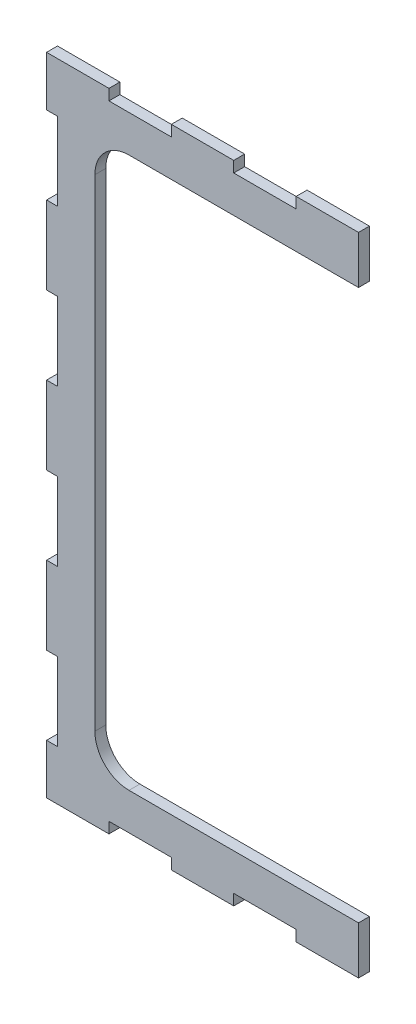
from build123d import *

# Parameters (mm, degrees)
BOSS_EXTRUDE1_DEPTH = 16
FILLET2_R           = 50


with BuildPart() as part:
    # Sketch1 → Boss-Extrude1 (new body)
    with BuildSketch(Plane.XY):
        Polygon((-311.421446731, 497.074365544), (-311.421446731, 513.074365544), (-402.861446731, 513.074365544), (-402.861446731, 497.074365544), (-494.301446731, 497.074365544), (-494.301446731, 513.074365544), (-585.741446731, 513.074365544), (-585.741446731, 439.922365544), (-569.741446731, 439.922365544), (-569.741446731, 325.622365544), (-585.741446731, 325.622365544), (-585.741446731, 211.323698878), (-569.741446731, 211.323698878), (-569.741446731, 97.023698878), (-585.741446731, 97.023698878), (-585.741446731, -17.274967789), (-569.741446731, -17.274967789), (-569.741446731, -131.574967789), (-585.741446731, -131.574967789), (-585.741446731, -245.873634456), (-569.741446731, -245.873634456), (-569.741446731, -360.173634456), (-585.741446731, -360.173634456), (-585.741446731, -433.325634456), (-494.301446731, -433.325634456), (-494.301446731, -417.325634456), (-402.861446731, -417.325634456), (-402.861446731, -433.325634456), (-311.421446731, -433.325634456), (-311.421446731, -417.325634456), (-219.981446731, -417.325634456), (-219.981446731, -433.325634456), (-128.541446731, -433.325634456), (-128.541446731, -363.325634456), (-514.981446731, -363.325634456), (-514.981446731, 443.074365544), (-128.541446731, 443.074365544), (-128.541446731, 513.074365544), (-219.981446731, 513.074365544), (-219.981446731, 497.074365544), align=None)
    extrude(amount=BOSS_EXTRUDE1_DEPTH)

    # Fillet2
    fillet2_edges = [part.edges().sort_by_distance(p)[0] for p in [
        (-514.981446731, 443.074365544, 8),
        (-514.981446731, -363.325634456, 8),
    ]]
    fillet(fillet2_edges, radius=FILLET2_R)


solid = part.part
